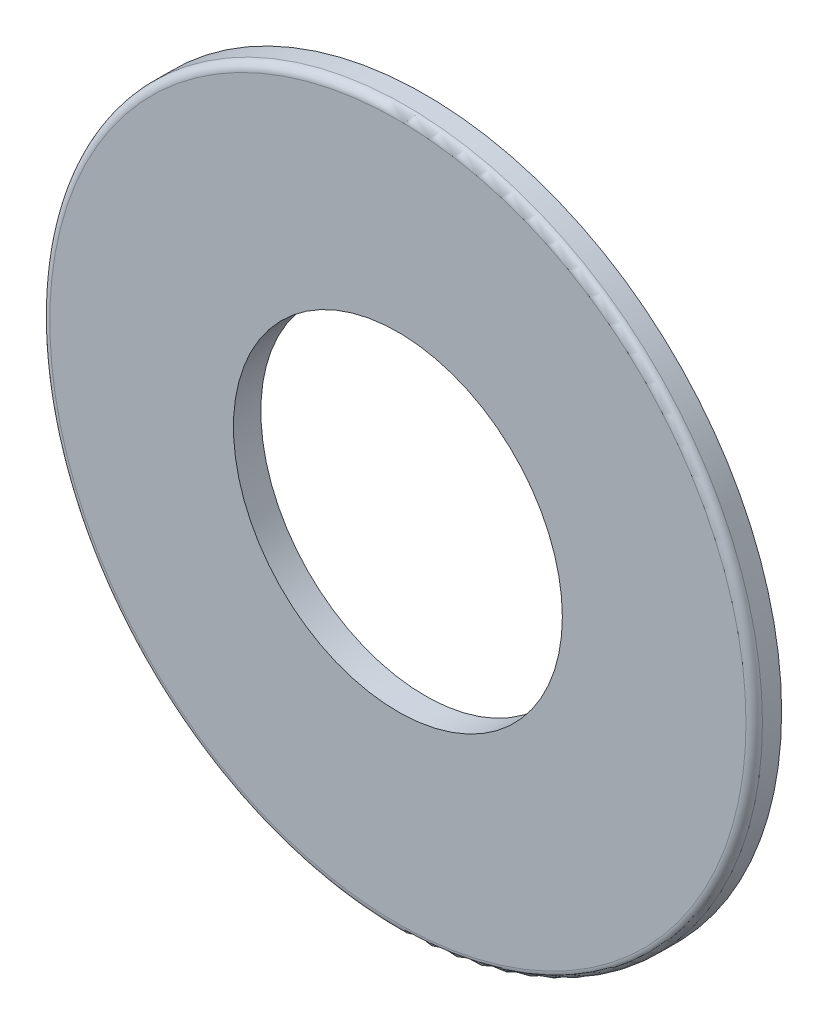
from build123d import *

# Parameters (mm, degrees)
ESQUISSE1_R      = 13
ESQUISSE1_R_2    = 6
EXTRUSION1_DEPTH = 1
CONG_1_R         = 0.3


with BuildPart() as part:
    # Esquisse1 → Extrusion1 (new body)
    with BuildSketch(Plane.XY):
        with Locations((82.878794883, 208.830726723)):
            Circle(ESQUISSE1_R)
        with Locations((82.878794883, 208.830726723)):
            Circle(ESQUISSE1_R_2, mode=Mode.SUBTRACT)
    extrude(amount=EXTRUSION1_DEPTH)

    # Cong_1
    cong_1_edges = [part.edges().sort_by_distance(p)[0] for p in [
        (69.878794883, 208.830726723, 1),
    ]]
    fillet(cong_1_edges, radius=CONG_1_R)


solid = part.part
